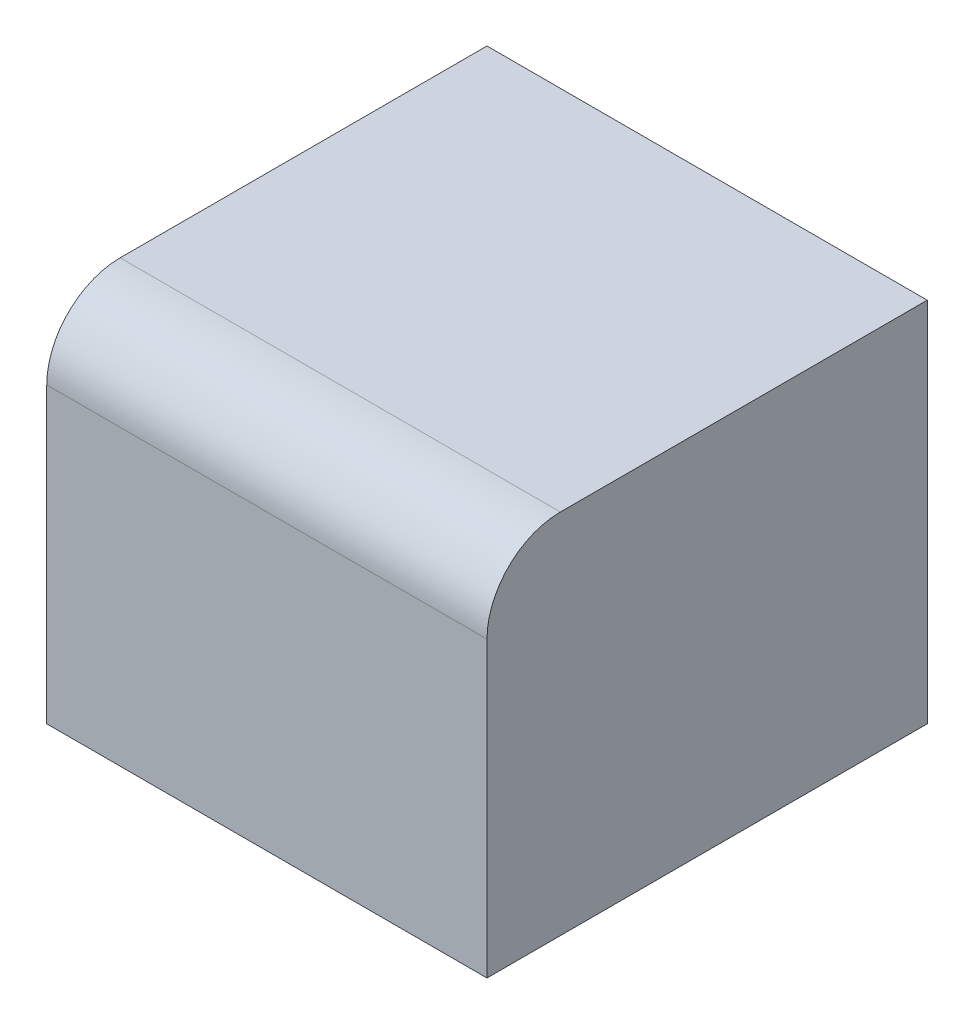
ISO-10303-21;
HEADER;
FILE_DESCRIPTION(('STEP AP214'),'2;1');
FILE_NAME('part.step','',(''),(''),'','','');
FILE_SCHEMA(('AUTOMOTIVE_DESIGN { 1 0 10303 214 1 1 1 1 }'));
ENDSEC;
DATA;
#1=APPLICATION_CONTEXT('core data for automotive mechanical design processes');
#2=APPLICATION_PROTOCOL_DEFINITION('international standard','automotive_design',2000,#1);
#3=PRODUCT_CONTEXT('',#1,'mechanical');
#4=PRODUCT('Part','Part','',(#3));
#5=PRODUCT_RELATED_PRODUCT_CATEGORY('part','',(#4));
#6=PRODUCT_DEFINITION_FORMATION('','',#4);
#7=PRODUCT_DEFINITION_CONTEXT('part definition',#1,'design');
#8=PRODUCT_DEFINITION('design','',#6,#7);
#9=PRODUCT_DEFINITION_SHAPE('','',#8);
#10=(LENGTH_UNIT() NAMED_UNIT(*) SI_UNIT(.MILLI.,.METRE.));
#11=(NAMED_UNIT(*) PLANE_ANGLE_UNIT() SI_UNIT($,.RADIAN.));
#12=(NAMED_UNIT(*) SI_UNIT($,.STERADIAN.) SOLID_ANGLE_UNIT());
#13=UNCERTAINTY_MEASURE_WITH_UNIT(LENGTH_MEASURE(1.E-05),#10,'distance_accuracy_value','');
#14=(GEOMETRIC_REPRESENTATION_CONTEXT(3) GLOBAL_UNCERTAINTY_ASSIGNED_CONTEXT((#13)) GLOBAL_UNIT_ASSIGNED_CONTEXT((#10,
#11,#12)) REPRESENTATION_CONTEXT('',''));
#15=CARTESIAN_POINT('',(0.,0.,0.));
#16=DIRECTION('',(0.,0.,1.));
#17=DIRECTION('',(1.,0.,0.));
#18=AXIS2_PLACEMENT_3D('',#15,#16,#17);
#19=CARTESIAN_POINT('',(30.,50.,30.));
#20=DIRECTION('',(-1.,0.,0.));
#21=DIRECTION('',(0.,0.,1.));
#22=AXIS2_PLACEMENT_3D('',#19,#20,#21);
#23=PLANE('',#22);
#24=DIRECTION('',(0.,0.,-1.));
#25=VECTOR('',#24,1.);
#26=CARTESIAN_POINT('',(30.,50.,30.));
#27=LINE('',#26,#25);
#28=CARTESIAN_POINT('',(30.,50.,20.));
#29=VERTEX_POINT('',#28);
#30=CARTESIAN_POINT('',(30.,50.,-30.));
#31=VERTEX_POINT('',#30);
#32=EDGE_CURVE('E76',#29,#31,#27,.T.);
#33=ORIENTED_EDGE('',*,*,#32,.F.);
#34=CARTESIAN_POINT('',(30.,40.,20.));
#35=DIRECTION('',(-1.,0.,0.));
#36=DIRECTION('',(0.,0.,1.));
#37=AXIS2_PLACEMENT_3D('',#34,#35,#36);
#38=CIRCLE('',#37,10.);
#39=CARTESIAN_POINT('',(30.,40.,30.));
#40=VERTEX_POINT('',#39);
#41=EDGE_CURVE('E54',#29,#40,#38,.F.);
#42=ORIENTED_EDGE('',*,*,#41,.T.);
#43=DIRECTION('',(0.,-1.,0.));
#44=VECTOR('',#43,1.);
#45=CARTESIAN_POINT('',(30.,50.,30.));
#46=LINE('',#45,#44);
#47=CARTESIAN_POINT('',(30.,0.,30.));
#48=VERTEX_POINT('',#47);
#49=EDGE_CURVE('E106',#40,#48,#46,.T.);
#50=ORIENTED_EDGE('',*,*,#49,.T.);
#51=DIRECTION('',(0.,0.,-1.));
#52=VECTOR('',#51,1.);
#53=CARTESIAN_POINT('',(30.,0.,30.));
#54=LINE('',#53,#52);
#55=CARTESIAN_POINT('',(30.,0.,-30.));
#56=VERTEX_POINT('',#55);
#57=EDGE_CURVE('E98',#48,#56,#54,.T.);
#58=ORIENTED_EDGE('',*,*,#57,.T.);
#59=DIRECTION('',(0.,-1.,0.));
#60=VECTOR('',#59,1.);
#61=CARTESIAN_POINT('',(30.,50.,-30.));
#62=LINE('',#61,#60);
#63=EDGE_CURVE('E90',#31,#56,#62,.T.);
#64=ORIENTED_EDGE('',*,*,#63,.F.);
#65=EDGE_LOOP('',(#33,#42,#50,#58,#64));
#66=FACE_BOUND('',#65,.T.);
#67=ADVANCED_FACE('F32',(#66),#23,.F.);
#68=CARTESIAN_POINT('',(-30.,50.,-30.));
#69=DIRECTION('',(0.,0.,1.));
#70=DIRECTION('',(1.,0.,0.));
#71=AXIS2_PLACEMENT_3D('',#68,#69,#70);
#72=PLANE('',#71);
#73=DIRECTION('',(-1.,0.,0.));
#74=VECTOR('',#73,1.);
#75=CARTESIAN_POINT('',(-30.,0.,-30.));
#76=LINE('',#75,#74);
#77=CARTESIAN_POINT('',(-30.,0.,-30.));
#78=VERTEX_POINT('',#77);
#79=EDGE_CURVE('E113',#56,#78,#76,.T.);
#80=ORIENTED_EDGE('',*,*,#79,.T.);
#81=DIRECTION('',(0.,-1.,0.));
#82=VECTOR('',#81,1.);
#83=CARTESIAN_POINT('',(-30.,50.,-30.));
#84=LINE('',#83,#82);
#85=CARTESIAN_POINT('',(-30.,50.,-30.));
#86=VERTEX_POINT('',#85);
#87=EDGE_CURVE('E93',#86,#78,#84,.T.);
#88=ORIENTED_EDGE('',*,*,#87,.F.);
#89=DIRECTION('',(-1.,0.,0.));
#90=VECTOR('',#89,1.);
#91=CARTESIAN_POINT('',(-30.,50.,-30.));
#92=LINE('',#91,#90);
#93=EDGE_CURVE('E80',#31,#86,#92,.T.);
#94=ORIENTED_EDGE('',*,*,#93,.F.);
#95=ORIENTED_EDGE('',*,*,#63,.T.);
#96=EDGE_LOOP('',(#80,#88,#94,#95));
#97=FACE_BOUND('',#96,.T.);
#98=ADVANCED_FACE('F89',(#97),#72,.F.);
#99=CARTESIAN_POINT('',(-30.,50.,30.));
#100=DIRECTION('',(1.,0.,0.));
#101=DIRECTION('',(0.,0.,-1.));
#102=AXIS2_PLACEMENT_3D('',#99,#100,#101);
#103=PLANE('',#102);
#104=DIRECTION('',(0.,-1.,0.));
#105=VECTOR('',#104,1.);
#106=CARTESIAN_POINT('',(-30.,50.,30.));
#107=LINE('',#106,#105);
#108=CARTESIAN_POINT('',(-30.,40.,30.));
#109=VERTEX_POINT('',#108);
#110=CARTESIAN_POINT('',(-30.,0.,30.));
#111=VERTEX_POINT('',#110);
#112=EDGE_CURVE('E101',#109,#111,#107,.T.);
#113=ORIENTED_EDGE('',*,*,#112,.F.);
#114=CARTESIAN_POINT('',(-30.,40.,20.));
#115=DIRECTION('',(1.,0.,0.));
#116=DIRECTION('',(0.,0.,-1.));
#117=AXIS2_PLACEMENT_3D('',#114,#115,#116);
#118=CIRCLE('',#117,10.);
#119=CARTESIAN_POINT('',(-30.,50.,20.));
#120=VERTEX_POINT('',#119);
#121=EDGE_CURVE('E11',#109,#120,#118,.F.);
#122=ORIENTED_EDGE('',*,*,#121,.T.);
#123=DIRECTION('',(0.,0.,1.));
#124=VECTOR('',#123,1.);
#125=CARTESIAN_POINT('',(-30.,50.,30.));
#126=LINE('',#125,#124);
#127=EDGE_CURVE('E95',#86,#120,#126,.T.);
#128=ORIENTED_EDGE('',*,*,#127,.F.);
#129=ORIENTED_EDGE('',*,*,#87,.T.);
#130=DIRECTION('',(0.,0.,1.));
#131=VECTOR('',#130,1.);
#132=CARTESIAN_POINT('',(-30.,0.,30.));
#133=LINE('',#132,#131);
#134=EDGE_CURVE('E110',#78,#111,#133,.T.);
#135=ORIENTED_EDGE('',*,*,#134,.T.);
#136=EDGE_LOOP('',(#113,#122,#128,#129,#135));
#137=FACE_BOUND('',#136,.T.);
#138=ADVANCED_FACE('F119',(#137),#103,.F.);
#139=CARTESIAN_POINT('',(-30.,50.,30.));
#140=DIRECTION('',(0.,0.,-1.));
#141=DIRECTION('',(-1.,0.,0.));
#142=AXIS2_PLACEMENT_3D('',#139,#140,#141);
#143=PLANE('',#142);
#144=ORIENTED_EDGE('',*,*,#49,.F.);
#145=DIRECTION('',(1.,0.,0.));
#146=VECTOR('',#145,1.);
#147=CARTESIAN_POINT('',(-30.,40.,30.));
#148=LINE('',#147,#146);
#149=EDGE_CURVE('E40',#40,#109,#148,.F.);
#150=ORIENTED_EDGE('',*,*,#149,.T.);
#151=ORIENTED_EDGE('',*,*,#112,.T.);
#152=DIRECTION('',(1.,0.,0.));
#153=VECTOR('',#152,1.);
#154=CARTESIAN_POINT('',(-30.,0.,30.));
#155=LINE('',#154,#153);
#156=EDGE_CURVE('E85',#111,#48,#155,.T.);
#157=ORIENTED_EDGE('',*,*,#156,.T.);
#158=EDGE_LOOP('',(#144,#150,#151,#157));
#159=FACE_BOUND('',#158,.T.);
#160=ADVANCED_FACE('F122',(#159),#143,.F.);
#161=CARTESIAN_POINT('',(0.,50.,0.));
#162=DIRECTION('',(0.,-1.,0.));
#163=DIRECTION('',(0.,0.,-1.));
#164=AXIS2_PLACEMENT_3D('',#161,#162,#163);
#165=PLANE('',#164);
#166=ORIENTED_EDGE('',*,*,#127,.T.);
#167=DIRECTION('',(1.,0.,0.));
#168=VECTOR('',#167,1.);
#169=CARTESIAN_POINT('',(0.,50.,20.));
#170=LINE('',#169,#168);
#171=EDGE_CURVE('E83',#120,#29,#170,.T.);
#172=ORIENTED_EDGE('',*,*,#171,.T.);
#173=ORIENTED_EDGE('',*,*,#32,.T.);
#174=ORIENTED_EDGE('',*,*,#93,.T.);
#175=EDGE_LOOP('',(#166,#172,#173,#174));
#176=FACE_BOUND('',#175,.T.);
#177=ADVANCED_FACE('F79',(#176),#165,.F.);
#178=CARTESIAN_POINT('',(0.,0.,0.));
#179=DIRECTION('',(0.,-1.,0.));
#180=DIRECTION('',(0.,0.,-1.));
#181=AXIS2_PLACEMENT_3D('',#178,#179,#180);
#182=PLANE('',#181);
#183=ORIENTED_EDGE('',*,*,#57,.F.);
#184=ORIENTED_EDGE('',*,*,#156,.F.);
#185=ORIENTED_EDGE('',*,*,#134,.F.);
#186=ORIENTED_EDGE('',*,*,#79,.F.);
#187=EDGE_LOOP('',(#183,#184,#185,#186));
#188=FACE_BOUND('',#187,.T.);
#189=ADVANCED_FACE('F124',(#188),#182,.T.);
#190=CARTESIAN_POINT('',(0.,40.,20.));
#191=DIRECTION('',(1.,0.,0.));
#192=DIRECTION('',(0.,0.,-1.));
#193=AXIS2_PLACEMENT_3D('',#190,#191,#192);
#194=CYLINDRICAL_SURFACE('',#193,10.);
#195=ORIENTED_EDGE('',*,*,#121,.F.);
#196=ORIENTED_EDGE('',*,*,#149,.F.);
#197=ORIENTED_EDGE('',*,*,#41,.F.);
#198=ORIENTED_EDGE('',*,*,#171,.F.);
#199=EDGE_LOOP('',(#195,#196,#197,#198));
#200=FACE_BOUND('',#199,.T.);
#201=ADVANCED_FACE('F34',(#200),#194,.T.);
#202=CLOSED_SHELL('',(#67,#98,#138,#160,#177,#189,#201));
#203=MANIFOLD_SOLID_BREP('B2',#202);
#204=ADVANCED_BREP_SHAPE_REPRESENTATION('',(#18,#203),#14);
#205=SHAPE_DEFINITION_REPRESENTATION(#9,#204);
ENDSEC;
END-ISO-10303-21;
